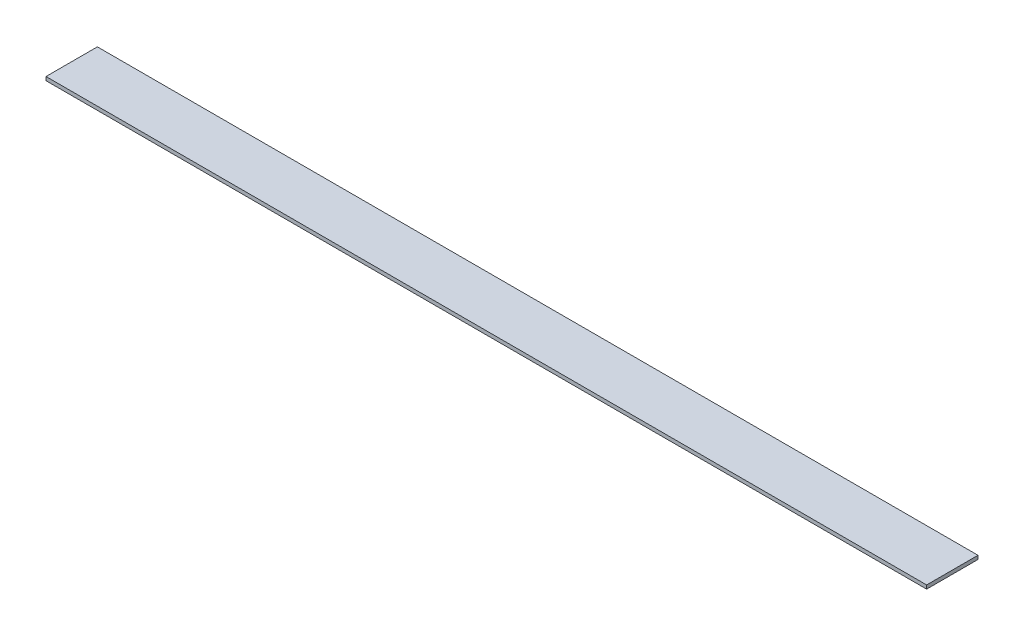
from build123d import *

# Parameters (mm, degrees)
SKETCH1_W           = 3048
SKETCH1_H           = 177.8
BOSS_EXTRUDE1_DEPTH = 12.7


with BuildPart() as part:
    # Sketch1 → Boss-Extrude1 (new body)
    with BuildSketch(Plane(origin=(0, 0, 0), x_dir=(1, 0, 0), z_dir=(0, 1, 0))):
        Rectangle(SKETCH1_W, SKETCH1_H)
    extrude(amount=BOSS_EXTRUDE1_DEPTH)


solid = part.part
